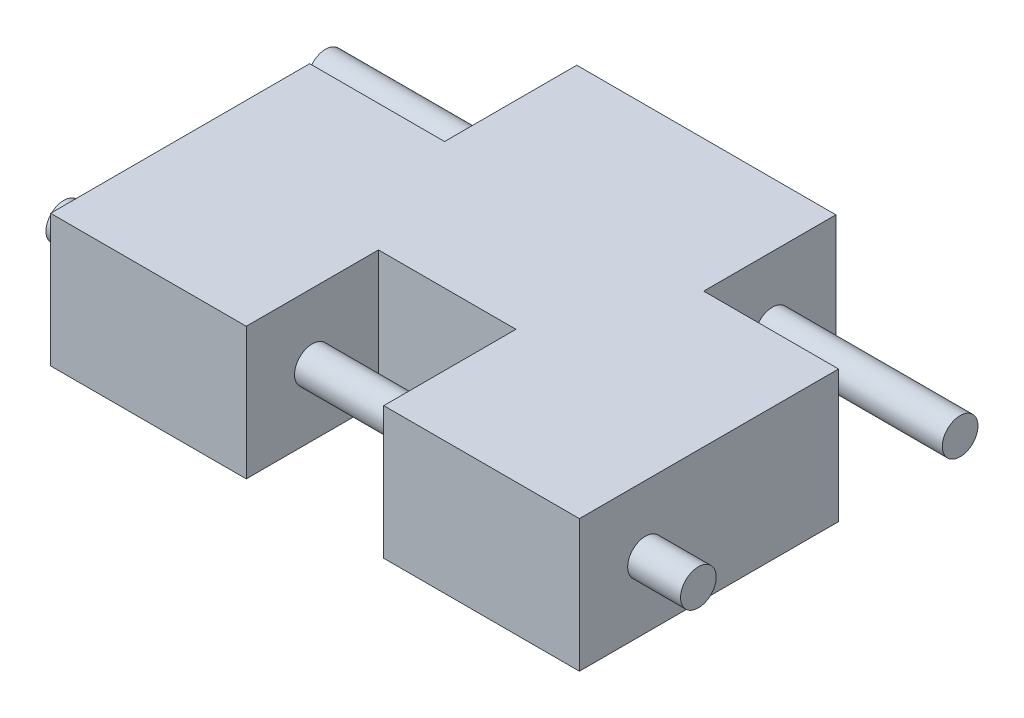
ISO-10303-21;
HEADER;
FILE_DESCRIPTION(('STEP AP214'),'2;1');
FILE_NAME('part.step','',(''),(''),'','','');
FILE_SCHEMA(('AUTOMOTIVE_DESIGN { 1 0 10303 214 1 1 1 1 }'));
ENDSEC;
DATA;
#1=APPLICATION_CONTEXT('core data for automotive mechanical design processes');
#2=APPLICATION_PROTOCOL_DEFINITION('international standard','automotive_design',2000,#1);
#3=PRODUCT_CONTEXT('',#1,'mechanical');
#4=PRODUCT('Part','Part','',(#3));
#5=PRODUCT_RELATED_PRODUCT_CATEGORY('part','',(#4));
#6=PRODUCT_DEFINITION_FORMATION('','',#4);
#7=PRODUCT_DEFINITION_CONTEXT('part definition',#1,'design');
#8=PRODUCT_DEFINITION('design','',#6,#7);
#9=PRODUCT_DEFINITION_SHAPE('','',#8);
#10=(LENGTH_UNIT() NAMED_UNIT(*) SI_UNIT(.MILLI.,.METRE.));
#11=(NAMED_UNIT(*) PLANE_ANGLE_UNIT() SI_UNIT($,.RADIAN.));
#12=(NAMED_UNIT(*) SI_UNIT($,.STERADIAN.) SOLID_ANGLE_UNIT());
#13=UNCERTAINTY_MEASURE_WITH_UNIT(LENGTH_MEASURE(1.E-05),#10,'distance_accuracy_value','');
#14=(GEOMETRIC_REPRESENTATION_CONTEXT(3) GLOBAL_UNCERTAINTY_ASSIGNED_CONTEXT((#13)) GLOBAL_UNIT_ASSIGNED_CONTEXT((#10,
#11,#12)) REPRESENTATION_CONTEXT('',''));
#15=CARTESIAN_POINT('',(0.,0.,0.));
#16=DIRECTION('',(0.,0.,1.));
#17=DIRECTION('',(1.,0.,0.));
#18=AXIS2_PLACEMENT_3D('',#15,#16,#17);
#19=CARTESIAN_POINT('',(-6.223,6.35,0.127));
#20=DIRECTION('',(1.,0.,0.));
#21=DIRECTION('',(0.,0.,-1.));
#22=AXIS2_PLACEMENT_3D('',#19,#20,#21);
#23=PLANE('',#22);
#24=CARTESIAN_POINT('',(-6.223,3.175,-3.175));
#25=DIRECTION('',(1.,0.,0.));
#26=DIRECTION('',(0.,0.,-1.));
#27=AXIS2_PLACEMENT_3D('',#24,#25,#26);
#28=CIRCLE('',#27,0.857250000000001);
#29=CARTESIAN_POINT('',(-6.223,3.175,-4.03225));
#30=VERTEX_POINT('',#29);
#31=EDGE_CURVE('E216',#30,#30,#28,.T.);
#32=ORIENTED_EDGE('',*,*,#31,.T.);
#33=EDGE_LOOP('',(#32));
#34=FACE_BOUND('',#33,.T.);
#35=DIRECTION('',(0.,0.,1.));
#36=VECTOR('',#35,1.);
#37=CARTESIAN_POINT('',(-6.223,0.,0.127));
#38=LINE('',#37,#36);
#39=CARTESIAN_POINT('',(-6.223,0.,-6.223));
#40=VERTEX_POINT('',#39);
#41=CARTESIAN_POINT('',(-6.223,0.,0.127));
#42=VERTEX_POINT('',#41);
#43=EDGE_CURVE('E155',#40,#42,#38,.T.);
#44=ORIENTED_EDGE('',*,*,#43,.T.);
#45=DIRECTION('',(0.,-1.,0.));
#46=VECTOR('',#45,1.);
#47=CARTESIAN_POINT('',(-6.223,6.35,0.127));
#48=LINE('',#47,#46);
#49=CARTESIAN_POINT('',(-6.223,6.35,0.127));
#50=VERTEX_POINT('',#49);
#51=EDGE_CURVE('E11',#50,#42,#48,.T.);
#52=ORIENTED_EDGE('',*,*,#51,.F.);
#53=DIRECTION('',(0.,0.,1.));
#54=VECTOR('',#53,1.);
#55=CARTESIAN_POINT('',(-6.223,6.35,0.127));
#56=LINE('',#55,#54);
#57=CARTESIAN_POINT('',(-6.223,6.35,-6.223));
#58=VERTEX_POINT('',#57);
#59=EDGE_CURVE('E178',#58,#50,#56,.T.);
#60=ORIENTED_EDGE('',*,*,#59,.F.);
#61=DIRECTION('',(0.,-1.,0.));
#62=VECTOR('',#61,1.);
#63=CARTESIAN_POINT('',(-6.223,6.35,-6.223));
#64=LINE('',#63,#62);
#65=EDGE_CURVE('E151',#58,#40,#64,.T.);
#66=ORIENTED_EDGE('',*,*,#65,.T.);
#67=EDGE_LOOP('',(#44,#52,#60,#66));
#68=FACE_BOUND('',#67,.T.);
#69=ADVANCED_FACE('F33',(#34,#68),#23,.F.);
#70=CARTESIAN_POINT('',(-12.7,6.35,0.127));
#71=DIRECTION('',(0.,0.,1.));
#72=DIRECTION('',(1.,0.,0.));
#73=AXIS2_PLACEMENT_3D('',#70,#71,#72);
#74=PLANE('',#73);
#75=DIRECTION('',(-1.,0.,0.));
#76=VECTOR('',#75,1.);
#77=CARTESIAN_POINT('',(-12.7,0.,0.127));
#78=LINE('',#77,#76);
#79=CARTESIAN_POINT('',(-12.7,0.,0.127));
#80=VERTEX_POINT('',#79);
#81=EDGE_CURVE('E158',#42,#80,#78,.T.);
#82=ORIENTED_EDGE('',*,*,#81,.T.);
#83=DIRECTION('',(0.,-1.,0.));
#84=VECTOR('',#83,1.);
#85=CARTESIAN_POINT('',(-12.7,6.35,0.127));
#86=LINE('',#85,#84);
#87=CARTESIAN_POINT('',(-12.7,6.35,0.127));
#88=VERTEX_POINT('',#87);
#89=EDGE_CURVE('E42',#88,#80,#86,.T.);
#90=ORIENTED_EDGE('',*,*,#89,.F.);
#91=DIRECTION('',(-1.,0.,0.));
#92=VECTOR('',#91,1.);
#93=CARTESIAN_POINT('',(-12.7,6.35,0.127));
#94=LINE('',#93,#92);
#95=EDGE_CURVE('E106',#50,#88,#94,.T.);
#96=ORIENTED_EDGE('',*,*,#95,.F.);
#97=ORIENTED_EDGE('',*,*,#51,.T.);
#98=EDGE_LOOP('',(#82,#90,#96,#97));
#99=FACE_BOUND('',#98,.T.);
#100=ADVANCED_FACE('F266',(#99),#74,.F.);
#101=CARTESIAN_POINT('',(-12.7,6.35,12.573));
#102=DIRECTION('',(1.,0.,0.));
#103=DIRECTION('',(0.,0.,-1.));
#104=AXIS2_PLACEMENT_3D('',#101,#102,#103);
#105=PLANE('',#104);
#106=CARTESIAN_POINT('',(-12.7,3.175,9.39800000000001));
#107=DIRECTION('',(1.,0.,0.));
#108=DIRECTION('',(0.,0.,-1.));
#109=AXIS2_PLACEMENT_3D('',#106,#107,#108);
#110=CIRCLE('',#109,0.85725);
#111=CARTESIAN_POINT('',(-12.7,3.175,8.54075000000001));
#112=VERTEX_POINT('',#111);
#113=EDGE_CURVE('E159',#112,#112,#110,.T.);
#114=ORIENTED_EDGE('',*,*,#113,.T.);
#115=EDGE_LOOP('',(#114));
#116=FACE_BOUND('',#115,.T.);
#117=DIRECTION('',(0.,0.,1.));
#118=VECTOR('',#117,1.);
#119=CARTESIAN_POINT('',(-12.7,0.,12.573));
#120=LINE('',#119,#118);
#121=CARTESIAN_POINT('',(-12.7,0.,12.573));
#122=VERTEX_POINT('',#121);
#123=EDGE_CURVE('E161',#80,#122,#120,.T.);
#124=ORIENTED_EDGE('',*,*,#123,.T.);
#125=DIRECTION('',(0.,-1.,0.));
#126=VECTOR('',#125,1.);
#127=CARTESIAN_POINT('',(-12.7,6.35,12.573));
#128=LINE('',#127,#126);
#129=CARTESIAN_POINT('',(-12.7,6.35,12.573));
#130=VERTEX_POINT('',#129);
#131=EDGE_CURVE('E197',#130,#122,#128,.T.);
#132=ORIENTED_EDGE('',*,*,#131,.F.);
#133=DIRECTION('',(0.,0.,1.));
#134=VECTOR('',#133,1.);
#135=CARTESIAN_POINT('',(-12.7,6.35,12.573));
#136=LINE('',#135,#134);
#137=EDGE_CURVE('E226',#88,#130,#136,.T.);
#138=ORIENTED_EDGE('',*,*,#137,.F.);
#139=ORIENTED_EDGE('',*,*,#89,.T.);
#140=EDGE_LOOP('',(#124,#132,#138,#139));
#141=FACE_BOUND('',#140,.T.);
#142=ADVANCED_FACE('F271',(#116,#141),#105,.F.);
#143=CARTESIAN_POINT('',(-3.302,6.35,12.573));
#144=DIRECTION('',(0.,0.,-1.));
#145=DIRECTION('',(-1.,0.,0.));
#146=AXIS2_PLACEMENT_3D('',#143,#144,#145);
#147=PLANE('',#146);
#148=DIRECTION('',(1.,0.,0.));
#149=VECTOR('',#148,1.);
#150=CARTESIAN_POINT('',(-3.302,0.,12.573));
#151=LINE('',#150,#149);
#152=CARTESIAN_POINT('',(-3.302,0.,12.573));
#153=VERTEX_POINT('',#152);
#154=EDGE_CURVE('E163',#122,#153,#151,.T.);
#155=ORIENTED_EDGE('',*,*,#154,.T.);
#156=DIRECTION('',(0.,-1.,0.));
#157=VECTOR('',#156,1.);
#158=CARTESIAN_POINT('',(-3.302,6.35,12.573));
#159=LINE('',#158,#157);
#160=CARTESIAN_POINT('',(-3.302,6.35,12.573));
#161=VERTEX_POINT('',#160);
#162=EDGE_CURVE('E194',#161,#153,#159,.T.);
#163=ORIENTED_EDGE('',*,*,#162,.F.);
#164=DIRECTION('',(1.,0.,0.));
#165=VECTOR('',#164,1.);
#166=CARTESIAN_POINT('',(-3.302,6.35,12.573));
#167=LINE('',#166,#165);
#168=EDGE_CURVE('E228',#130,#161,#167,.T.);
#169=ORIENTED_EDGE('',*,*,#168,.F.);
#170=ORIENTED_EDGE('',*,*,#131,.T.);
#171=EDGE_LOOP('',(#155,#163,#169,#170));
#172=FACE_BOUND('',#171,.T.);
#173=ADVANCED_FACE('F441',(#172),#147,.F.);
#174=CARTESIAN_POINT('',(-3.302,6.35,6.223));
#175=DIRECTION('',(-1.,0.,0.));
#176=DIRECTION('',(0.,0.,1.));
#177=AXIS2_PLACEMENT_3D('',#174,#175,#176);
#178=PLANE('',#177);
#179=CARTESIAN_POINT('',(-3.302,3.175,9.398));
#180=DIRECTION('',(-1.,0.,0.));
#181=DIRECTION('',(0.,0.,1.));
#182=AXIS2_PLACEMENT_3D('',#179,#180,#181);
#183=CIRCLE('',#182,0.85725);
#184=CARTESIAN_POINT('',(-3.302,3.175,10.25525));
#185=VERTEX_POINT('',#184);
#186=EDGE_CURVE('E208',#185,#185,#183,.T.);
#187=ORIENTED_EDGE('',*,*,#186,.T.);
#188=EDGE_LOOP('',(#187));
#189=FACE_BOUND('',#188,.T.);
#190=DIRECTION('',(0.,0.,-1.));
#191=VECTOR('',#190,1.);
#192=CARTESIAN_POINT('',(-3.302,0.,6.223));
#193=LINE('',#192,#191);
#194=CARTESIAN_POINT('',(-3.302,0.,6.223));
#195=VERTEX_POINT('',#194);
#196=EDGE_CURVE('E165',#153,#195,#193,.T.);
#197=ORIENTED_EDGE('',*,*,#196,.T.);
#198=DIRECTION('',(0.,-1.,0.));
#199=VECTOR('',#198,1.);
#200=CARTESIAN_POINT('',(-3.302,6.35,6.223));
#201=LINE('',#200,#199);
#202=CARTESIAN_POINT('',(-3.302,6.35,6.223));
#203=VERTEX_POINT('',#202);
#204=EDGE_CURVE('E191',#203,#195,#201,.T.);
#205=ORIENTED_EDGE('',*,*,#204,.F.);
#206=DIRECTION('',(0.,0.,-1.));
#207=VECTOR('',#206,1.);
#208=CARTESIAN_POINT('',(-3.302,6.35,6.223));
#209=LINE('',#208,#207);
#210=EDGE_CURVE('E230',#161,#203,#209,.T.);
#211=ORIENTED_EDGE('',*,*,#210,.F.);
#212=ORIENTED_EDGE('',*,*,#162,.T.);
#213=EDGE_LOOP('',(#197,#205,#211,#212));
#214=FACE_BOUND('',#213,.T.);
#215=ADVANCED_FACE('F432',(#189,#214),#178,.F.);
#216=CARTESIAN_POINT('',(3.302,6.35,6.223));
#217=DIRECTION('',(0.,0.,-1.));
#218=DIRECTION('',(-1.,0.,0.));
#219=AXIS2_PLACEMENT_3D('',#216,#217,#218);
#220=PLANE('',#219);
#221=DIRECTION('',(1.,0.,0.));
#222=VECTOR('',#221,1.);
#223=CARTESIAN_POINT('',(3.302,0.,6.223));
#224=LINE('',#223,#222);
#225=CARTESIAN_POINT('',(3.302,0.,6.223));
#226=VERTEX_POINT('',#225);
#227=EDGE_CURVE('E167',#195,#226,#224,.T.);
#228=ORIENTED_EDGE('',*,*,#227,.T.);
#229=DIRECTION('',(0.,-1.,0.));
#230=VECTOR('',#229,1.);
#231=CARTESIAN_POINT('',(3.302,6.35,6.223));
#232=LINE('',#231,#230);
#233=CARTESIAN_POINT('',(3.302,6.35,6.223));
#234=VERTEX_POINT('',#233);
#235=EDGE_CURVE('E188',#234,#226,#232,.T.);
#236=ORIENTED_EDGE('',*,*,#235,.F.);
#237=DIRECTION('',(1.,0.,0.));
#238=VECTOR('',#237,1.);
#239=CARTESIAN_POINT('',(3.302,6.35,6.223));
#240=LINE('',#239,#238);
#241=EDGE_CURVE('E232',#203,#234,#240,.T.);
#242=ORIENTED_EDGE('',*,*,#241,.F.);
#243=ORIENTED_EDGE('',*,*,#204,.T.);
#244=EDGE_LOOP('',(#228,#236,#242,#243));
#245=FACE_BOUND('',#244,.T.);
#246=ADVANCED_FACE('F423',(#245),#220,.F.);
#247=CARTESIAN_POINT('',(3.302,6.35,12.573));
#248=DIRECTION('',(1.,0.,0.));
#249=DIRECTION('',(0.,0.,-1.));
#250=AXIS2_PLACEMENT_3D('',#247,#248,#249);
#251=PLANE('',#250);
#252=CARTESIAN_POINT('',(3.302,3.175,9.398));
#253=DIRECTION('',(1.,0.,0.));
#254=DIRECTION('',(0.,0.,-1.));
#255=AXIS2_PLACEMENT_3D('',#252,#253,#254);
#256=CIRCLE('',#255,0.85725);
#257=CARTESIAN_POINT('',(3.302,3.175,8.54075));
#258=VERTEX_POINT('',#257);
#259=EDGE_CURVE('E203',#258,#258,#256,.T.);
#260=ORIENTED_EDGE('',*,*,#259,.T.);
#261=EDGE_LOOP('',(#260));
#262=FACE_BOUND('',#261,.T.);
#263=DIRECTION('',(0.,0.,1.));
#264=VECTOR('',#263,1.);
#265=CARTESIAN_POINT('',(3.302,0.,12.573));
#266=LINE('',#265,#264);
#267=CARTESIAN_POINT('',(3.302,0.,12.573));
#268=VERTEX_POINT('',#267);
#269=EDGE_CURVE('E169',#226,#268,#266,.T.);
#270=ORIENTED_EDGE('',*,*,#269,.T.);
#271=DIRECTION('',(0.,-1.,0.));
#272=VECTOR('',#271,1.);
#273=CARTESIAN_POINT('',(3.302,6.35,12.573));
#274=LINE('',#273,#272);
#275=CARTESIAN_POINT('',(3.302,6.35,12.573));
#276=VERTEX_POINT('',#275);
#277=EDGE_CURVE('E185',#276,#268,#274,.T.);
#278=ORIENTED_EDGE('',*,*,#277,.F.);
#279=DIRECTION('',(0.,0.,1.));
#280=VECTOR('',#279,1.);
#281=CARTESIAN_POINT('',(3.302,6.35,12.573));
#282=LINE('',#281,#280);
#283=EDGE_CURVE('E234',#234,#276,#282,.T.);
#284=ORIENTED_EDGE('',*,*,#283,.F.);
#285=ORIENTED_EDGE('',*,*,#235,.T.);
#286=EDGE_LOOP('',(#270,#278,#284,#285));
#287=FACE_BOUND('',#286,.T.);
#288=ADVANCED_FACE('F415',(#262,#287),#251,.F.);
#289=CARTESIAN_POINT('',(12.7,6.35,12.573));
#290=DIRECTION('',(0.,0.,-1.));
#291=DIRECTION('',(-1.,0.,0.));
#292=AXIS2_PLACEMENT_3D('',#289,#290,#291);
#293=PLANE('',#292);
#294=DIRECTION('',(1.,0.,0.));
#295=VECTOR('',#294,1.);
#296=CARTESIAN_POINT('',(12.7,0.,12.573));
#297=LINE('',#296,#295);
#298=CARTESIAN_POINT('',(12.7,0.,12.573));
#299=VERTEX_POINT('',#298);
#300=EDGE_CURVE('E171',#268,#299,#297,.T.);
#301=ORIENTED_EDGE('',*,*,#300,.T.);
#302=DIRECTION('',(0.,-1.,0.));
#303=VECTOR('',#302,1.);
#304=CARTESIAN_POINT('',(12.7,6.35,12.573));
#305=LINE('',#304,#303);
#306=CARTESIAN_POINT('',(12.7,6.35,12.573));
#307=VERTEX_POINT('',#306);
#308=EDGE_CURVE('E182',#307,#299,#305,.T.);
#309=ORIENTED_EDGE('',*,*,#308,.F.);
#310=DIRECTION('',(1.,0.,0.));
#311=VECTOR('',#310,1.);
#312=CARTESIAN_POINT('',(12.7,6.35,12.573));
#313=LINE('',#312,#311);
#314=EDGE_CURVE('E236',#276,#307,#313,.T.);
#315=ORIENTED_EDGE('',*,*,#314,.F.);
#316=ORIENTED_EDGE('',*,*,#277,.T.);
#317=EDGE_LOOP('',(#301,#309,#315,#316));
#318=FACE_BOUND('',#317,.T.);
#319=ADVANCED_FACE('F242',(#318),#293,.F.);
#320=CARTESIAN_POINT('',(12.7,6.35,0.127));
#321=DIRECTION('',(-1.,0.,0.));
#322=DIRECTION('',(0.,0.,1.));
#323=AXIS2_PLACEMENT_3D('',#320,#321,#322);
#324=PLANE('',#323);
#325=CARTESIAN_POINT('',(12.7,3.175,9.398));
#326=DIRECTION('',(-1.,0.,0.));
#327=DIRECTION('',(0.,0.,1.));
#328=AXIS2_PLACEMENT_3D('',#325,#326,#327);
#329=CIRCLE('',#328,0.85725);
#330=CARTESIAN_POINT('',(12.7,3.175,10.25525));
#331=VERTEX_POINT('',#330);
#332=EDGE_CURVE('E201',#331,#331,#329,.T.);
#333=ORIENTED_EDGE('',*,*,#332,.T.);
#334=EDGE_LOOP('',(#333));
#335=FACE_BOUND('',#334,.T.);
#336=DIRECTION('',(0.,0.,-1.));
#337=VECTOR('',#336,1.);
#338=CARTESIAN_POINT('',(12.7,0.,0.127));
#339=LINE('',#338,#337);
#340=CARTESIAN_POINT('',(12.7,0.,0.127));
#341=VERTEX_POINT('',#340);
#342=EDGE_CURVE('E173',#299,#341,#339,.T.);
#343=ORIENTED_EDGE('',*,*,#342,.T.);
#344=DIRECTION('',(0.,-1.,0.));
#345=VECTOR('',#344,1.);
#346=CARTESIAN_POINT('',(12.7,6.35,0.127));
#347=LINE('',#346,#345);
#348=CARTESIAN_POINT('',(12.7,6.35,0.127));
#349=VERTEX_POINT('',#348);
#350=EDGE_CURVE('E146',#349,#341,#347,.T.);
#351=ORIENTED_EDGE('',*,*,#350,.F.);
#352=DIRECTION('',(0.,0.,-1.));
#353=VECTOR('',#352,1.);
#354=CARTESIAN_POINT('',(12.7,6.35,0.127));
#355=LINE('',#354,#353);
#356=EDGE_CURVE('E137',#307,#349,#355,.T.);
#357=ORIENTED_EDGE('',*,*,#356,.F.);
#358=ORIENTED_EDGE('',*,*,#308,.T.);
#359=EDGE_LOOP('',(#343,#351,#357,#358));
#360=FACE_BOUND('',#359,.T.);
#361=ADVANCED_FACE('F246',(#335,#360),#324,.F.);
#362=CARTESIAN_POINT('',(6.223,6.35,0.127));
#363=DIRECTION('',(0.,0.,1.));
#364=DIRECTION('',(1.,0.,0.));
#365=AXIS2_PLACEMENT_3D('',#362,#363,#364);
#366=PLANE('',#365);
#367=DIRECTION('',(-1.,0.,0.));
#368=VECTOR('',#367,1.);
#369=CARTESIAN_POINT('',(6.223,0.,0.127));
#370=LINE('',#369,#368);
#371=CARTESIAN_POINT('',(6.223,0.,0.127));
#372=VERTEX_POINT('',#371);
#373=EDGE_CURVE('E145',#341,#372,#370,.T.);
#374=ORIENTED_EDGE('',*,*,#373,.T.);
#375=DIRECTION('',(0.,-1.,0.));
#376=VECTOR('',#375,1.);
#377=CARTESIAN_POINT('',(6.223,6.35,0.127));
#378=LINE('',#377,#376);
#379=CARTESIAN_POINT('',(6.223,6.35,0.127));
#380=VERTEX_POINT('',#379);
#381=EDGE_CURVE('E142',#380,#372,#378,.T.);
#382=ORIENTED_EDGE('',*,*,#381,.F.);
#383=DIRECTION('',(-1.,0.,0.));
#384=VECTOR('',#383,1.);
#385=CARTESIAN_POINT('',(6.223,6.35,0.127));
#386=LINE('',#385,#384);
#387=EDGE_CURVE('E131',#349,#380,#386,.T.);
#388=ORIENTED_EDGE('',*,*,#387,.F.);
#389=ORIENTED_EDGE('',*,*,#350,.T.);
#390=EDGE_LOOP('',(#374,#382,#388,#389));
#391=FACE_BOUND('',#390,.T.);
#392=ADVANCED_FACE('F143',(#391),#366,.F.);
#393=CARTESIAN_POINT('',(6.223,6.35,-6.223));
#394=DIRECTION('',(-1.,0.,0.));
#395=DIRECTION('',(0.,0.,1.));
#396=AXIS2_PLACEMENT_3D('',#393,#394,#395);
#397=PLANE('',#396);
#398=CARTESIAN_POINT('',(6.223,3.175,-3.175));
#399=DIRECTION('',(-1.,0.,0.));
#400=DIRECTION('',(0.,0.,1.));
#401=AXIS2_PLACEMENT_3D('',#398,#399,#400);
#402=CIRCLE('',#401,0.857250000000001);
#403=CARTESIAN_POINT('',(6.223,3.175,-2.31775));
#404=VERTEX_POINT('',#403);
#405=EDGE_CURVE('E36',#404,#404,#402,.T.);
#406=ORIENTED_EDGE('',*,*,#405,.T.);
#407=EDGE_LOOP('',(#406));
#408=FACE_BOUND('',#407,.T.);
#409=DIRECTION('',(0.,0.,-1.));
#410=VECTOR('',#409,1.);
#411=CARTESIAN_POINT('',(6.223,0.,-6.223));
#412=LINE('',#411,#410);
#413=CARTESIAN_POINT('',(6.223,0.,-6.223));
#414=VERTEX_POINT('',#413);
#415=EDGE_CURVE('E92',#372,#414,#412,.T.);
#416=ORIENTED_EDGE('',*,*,#415,.T.);
#417=DIRECTION('',(0.,-1.,0.));
#418=VECTOR('',#417,1.);
#419=CARTESIAN_POINT('',(6.223,6.35,-6.223));
#420=LINE('',#419,#418);
#421=CARTESIAN_POINT('',(6.223,6.35,-6.223));
#422=VERTEX_POINT('',#421);
#423=EDGE_CURVE('E147',#422,#414,#420,.T.);
#424=ORIENTED_EDGE('',*,*,#423,.F.);
#425=DIRECTION('',(0.,0.,-1.));
#426=VECTOR('',#425,1.);
#427=CARTESIAN_POINT('',(6.223,6.35,-6.223));
#428=LINE('',#427,#426);
#429=EDGE_CURVE('E135',#380,#422,#428,.T.);
#430=ORIENTED_EDGE('',*,*,#429,.F.);
#431=ORIENTED_EDGE('',*,*,#381,.T.);
#432=EDGE_LOOP('',(#416,#424,#430,#431));
#433=FACE_BOUND('',#432,.T.);
#434=ADVANCED_FACE('F149',(#408,#433),#397,.F.);
#435=CARTESIAN_POINT('',(-6.223,6.35,-6.223));
#436=DIRECTION('',(0.,0.,1.));
#437=DIRECTION('',(1.,0.,0.));
#438=AXIS2_PLACEMENT_3D('',#435,#436,#437);
#439=PLANE('',#438);
#440=DIRECTION('',(-1.,0.,0.));
#441=VECTOR('',#440,1.);
#442=CARTESIAN_POINT('',(-6.223,0.,-6.223));
#443=LINE('',#442,#441);
#444=EDGE_CURVE('E98',#414,#40,#443,.T.);
#445=ORIENTED_EDGE('',*,*,#444,.T.);
#446=ORIENTED_EDGE('',*,*,#65,.F.);
#447=DIRECTION('',(-1.,0.,0.));
#448=VECTOR('',#447,1.);
#449=CARTESIAN_POINT('',(-6.223,6.35,-6.223));
#450=LINE('',#449,#448);
#451=EDGE_CURVE('E51',#422,#58,#450,.T.);
#452=ORIENTED_EDGE('',*,*,#451,.F.);
#453=ORIENTED_EDGE('',*,*,#423,.T.);
#454=EDGE_LOOP('',(#445,#446,#452,#453));
#455=FACE_BOUND('',#454,.T.);
#456=ADVANCED_FACE('F254',(#455),#439,.F.);
#457=CARTESIAN_POINT('',(0.,6.35,0.));
#458=DIRECTION('',(0.,-1.,0.));
#459=DIRECTION('',(0.,0.,-1.));
#460=AXIS2_PLACEMENT_3D('',#457,#458,#459);
#461=PLANE('',#460);
#462=ORIENTED_EDGE('',*,*,#59,.T.);
#463=ORIENTED_EDGE('',*,*,#95,.T.);
#464=ORIENTED_EDGE('',*,*,#137,.T.);
#465=ORIENTED_EDGE('',*,*,#168,.T.);
#466=ORIENTED_EDGE('',*,*,#210,.T.);
#467=ORIENTED_EDGE('',*,*,#241,.T.);
#468=ORIENTED_EDGE('',*,*,#283,.T.);
#469=ORIENTED_EDGE('',*,*,#314,.T.);
#470=ORIENTED_EDGE('',*,*,#356,.T.);
#471=ORIENTED_EDGE('',*,*,#387,.T.);
#472=ORIENTED_EDGE('',*,*,#429,.T.);
#473=ORIENTED_EDGE('',*,*,#451,.T.);
#474=EDGE_LOOP('',(#462,#463,#464,#465,#466,#467,#468,#469,#470,#471,#472,#473));
#475=FACE_BOUND('',#474,.T.);
#476=ADVANCED_FACE('F133',(#475),#461,.F.);
#477=CARTESIAN_POINT('',(0.,0.,0.));
#478=DIRECTION('',(0.,-1.,0.));
#479=DIRECTION('',(0.,0.,-1.));
#480=AXIS2_PLACEMENT_3D('',#477,#478,#479);
#481=PLANE('',#480);
#482=ORIENTED_EDGE('',*,*,#43,.F.);
#483=ORIENTED_EDGE('',*,*,#444,.F.);
#484=ORIENTED_EDGE('',*,*,#415,.F.);
#485=ORIENTED_EDGE('',*,*,#373,.F.);
#486=ORIENTED_EDGE('',*,*,#342,.F.);
#487=ORIENTED_EDGE('',*,*,#300,.F.);
#488=ORIENTED_EDGE('',*,*,#269,.F.);
#489=ORIENTED_EDGE('',*,*,#227,.F.);
#490=ORIENTED_EDGE('',*,*,#196,.F.);
#491=ORIENTED_EDGE('',*,*,#154,.F.);
#492=ORIENTED_EDGE('',*,*,#123,.F.);
#493=ORIENTED_EDGE('',*,*,#81,.F.);
#494=EDGE_LOOP('',(#482,#483,#484,#485,#486,#487,#488,#489,#490,#491,#492,#493));
#495=FACE_BOUND('',#494,.T.);
#496=ADVANCED_FACE('F249',(#495),#481,.T.);
#497=CARTESIAN_POINT('',(15.24,3.175,9.398));
#498=DIRECTION('',(1.,0.,0.));
#499=DIRECTION('',(0.,0.,-1.));
#500=AXIS2_PLACEMENT_3D('',#497,#498,#499);
#501=PLANE('',#500);
#502=CARTESIAN_POINT('',(15.24,3.175,9.398));
#503=DIRECTION('',(1.,0.,0.));
#504=DIRECTION('',(0.,0.,-1.));
#505=AXIS2_PLACEMENT_3D('',#502,#503,#504);
#506=CIRCLE('',#505,0.85725);
#507=CARTESIAN_POINT('',(15.24,3.175,8.54075));
#508=VERTEX_POINT('',#507);
#509=EDGE_CURVE('E211',#508,#508,#506,.T.);
#510=ORIENTED_EDGE('',*,*,#509,.T.);
#511=EDGE_LOOP('',(#510));
#512=FACE_BOUND('',#511,.T.);
#513=ADVANCED_FACE('F302',(#512),#501,.T.);
#514=CARTESIAN_POINT('',(-15.24,3.175,9.39800000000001));
#515=DIRECTION('',(1.,0.,0.));
#516=DIRECTION('',(0.,0.,-1.));
#517=AXIS2_PLACEMENT_3D('',#514,#515,#516);
#518=CYLINDRICAL_SURFACE('',#517,0.85725);
#519=ORIENTED_EDGE('',*,*,#509,.F.);
#520=EDGE_LOOP('',(#519));
#521=FACE_BOUND('',#520,.T.);
#522=ORIENTED_EDGE('',*,*,#332,.F.);
#523=EDGE_LOOP('',(#522));
#524=FACE_BOUND('',#523,.T.);
#525=ADVANCED_FACE('F305',(#521,#524),#518,.T.);
#526=ORIENTED_EDGE('',*,*,#259,.F.);
#527=EDGE_LOOP('',(#526));
#528=FACE_BOUND('',#527,.T.);
#529=ORIENTED_EDGE('',*,*,#186,.F.);
#530=EDGE_LOOP('',(#529));
#531=FACE_BOUND('',#530,.T.);
#532=ADVANCED_FACE('F312',(#528,#531),#518,.T.);
#533=CARTESIAN_POINT('',(-15.24,3.175,9.39800000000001));
#534=DIRECTION('',(1.,0.,0.));
#535=DIRECTION('',(0.,0.,-1.));
#536=AXIS2_PLACEMENT_3D('',#533,#534,#535);
#537=CIRCLE('',#536,0.85725);
#538=CARTESIAN_POINT('',(-15.24,3.175,8.54075000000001));
#539=VERTEX_POINT('',#538);
#540=EDGE_CURVE('E204',#539,#539,#537,.T.);
#541=ORIENTED_EDGE('',*,*,#540,.T.);
#542=EDGE_LOOP('',(#541));
#543=FACE_BOUND('',#542,.T.);
#544=ORIENTED_EDGE('',*,*,#113,.F.);
#545=EDGE_LOOP('',(#544));
#546=FACE_BOUND('',#545,.T.);
#547=ADVANCED_FACE('F309',(#543,#546),#518,.T.);
#548=CARTESIAN_POINT('',(-15.24,3.175,9.39800000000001));
#549=DIRECTION('',(1.,0.,0.));
#550=DIRECTION('',(0.,0.,-1.));
#551=AXIS2_PLACEMENT_3D('',#548,#549,#550);
#552=PLANE('',#551);
#553=ORIENTED_EDGE('',*,*,#540,.F.);
#554=EDGE_LOOP('',(#553));
#555=FACE_BOUND('',#554,.T.);
#556=ADVANCED_FACE('F298',(#555),#552,.F.);
#557=CARTESIAN_POINT('',(15.24,3.175,-3.175));
#558=DIRECTION('',(1.,0.,0.));
#559=DIRECTION('',(0.,0.,-1.));
#560=AXIS2_PLACEMENT_3D('',#557,#558,#559);
#561=PLANE('',#560);
#562=CARTESIAN_POINT('',(15.24,3.175,-3.175));
#563=DIRECTION('',(1.,0.,0.));
#564=DIRECTION('',(0.,0.,-1.));
#565=AXIS2_PLACEMENT_3D('',#562,#563,#564);
#566=CIRCLE('',#565,0.857250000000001);
#567=CARTESIAN_POINT('',(15.24,3.175,-4.03225));
#568=VERTEX_POINT('',#567);
#569=EDGE_CURVE('E280',#568,#568,#566,.T.);
#570=ORIENTED_EDGE('',*,*,#569,.T.);
#571=EDGE_LOOP('',(#570));
#572=FACE_BOUND('',#571,.T.);
#573=ADVANCED_FACE('F284',(#572),#561,.T.);
#574=CARTESIAN_POINT('',(-15.24,3.175,-3.17499999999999));
#575=DIRECTION('',(1.,0.,0.));
#576=DIRECTION('',(0.,0.,-1.));
#577=AXIS2_PLACEMENT_3D('',#574,#575,#576);
#578=CYLINDRICAL_SURFACE('',#577,0.857250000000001);
#579=ORIENTED_EDGE('',*,*,#569,.F.);
#580=EDGE_LOOP('',(#579));
#581=FACE_BOUND('',#580,.T.);
#582=ORIENTED_EDGE('',*,*,#405,.F.);
#583=EDGE_LOOP('',(#582));
#584=FACE_BOUND('',#583,.T.);
#585=ADVANCED_FACE('F286',(#581,#584),#578,.T.);
#586=CARTESIAN_POINT('',(-15.24,3.175,-3.17499999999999));
#587=DIRECTION('',(1.,0.,0.));
#588=DIRECTION('',(0.,0.,-1.));
#589=AXIS2_PLACEMENT_3D('',#586,#587,#588);
#590=CIRCLE('',#589,0.857250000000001);
#591=CARTESIAN_POINT('',(-15.24,3.175,-4.03224999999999));
#592=VERTEX_POINT('',#591);
#593=EDGE_CURVE('E276',#592,#592,#590,.T.);
#594=ORIENTED_EDGE('',*,*,#593,.T.);
#595=EDGE_LOOP('',(#594));
#596=FACE_BOUND('',#595,.T.);
#597=ORIENTED_EDGE('',*,*,#31,.F.);
#598=EDGE_LOOP('',(#597));
#599=FACE_BOUND('',#598,.T.);
#600=ADVANCED_FACE('F289',(#596,#599),#578,.T.);
#601=CARTESIAN_POINT('',(-15.24,3.175,-3.17499999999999));
#602=DIRECTION('',(1.,0.,0.));
#603=DIRECTION('',(0.,0.,-1.));
#604=AXIS2_PLACEMENT_3D('',#601,#602,#603);
#605=PLANE('',#604);
#606=ORIENTED_EDGE('',*,*,#593,.F.);
#607=EDGE_LOOP('',(#606));
#608=FACE_BOUND('',#607,.T.);
#609=ADVANCED_FACE('F296',(#608),#605,.F.);
#610=CLOSED_SHELL('',(#69,#100,#142,#173,#215,#246,#288,#319,#361,#392,#434,#456,#476,#496,#513,
#525,#532,#547,#556,#573,#585,#600,#609));
#611=MANIFOLD_SOLID_BREP('B2',#610);
#612=ADVANCED_BREP_SHAPE_REPRESENTATION('',(#18,#611),#14);
#613=SHAPE_DEFINITION_REPRESENTATION(#9,#612);
ENDSEC;
END-ISO-10303-21;
